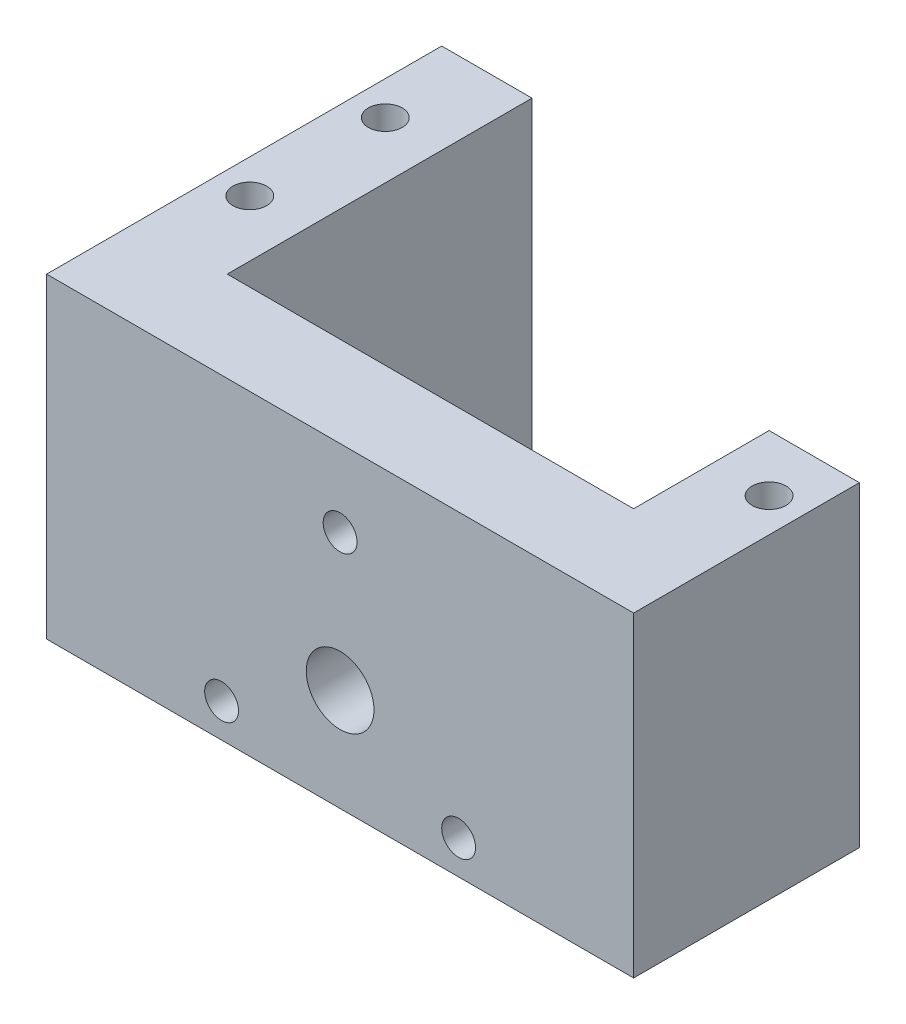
ISO-10303-21;
HEADER;
FILE_DESCRIPTION(('STEP AP214'),'2;1');
FILE_NAME('part.step','',(''),(''),'','','');
FILE_SCHEMA(('AUTOMOTIVE_DESIGN { 1 0 10303 214 1 1 1 1 }'));
ENDSEC;
DATA;
#1=APPLICATION_CONTEXT('core data for automotive mechanical design processes');
#2=APPLICATION_PROTOCOL_DEFINITION('international standard','automotive_design',2000,#1);
#3=PRODUCT_CONTEXT('',#1,'mechanical');
#4=PRODUCT('Part','Part','',(#3));
#5=PRODUCT_RELATED_PRODUCT_CATEGORY('part','',(#4));
#6=PRODUCT_DEFINITION_FORMATION('','',#4);
#7=PRODUCT_DEFINITION_CONTEXT('part definition',#1,'design');
#8=PRODUCT_DEFINITION('design','',#6,#7);
#9=PRODUCT_DEFINITION_SHAPE('','',#8);
#10=(LENGTH_UNIT() NAMED_UNIT(*) SI_UNIT(.MILLI.,.METRE.));
#11=(NAMED_UNIT(*) PLANE_ANGLE_UNIT() SI_UNIT($,.RADIAN.));
#12=(NAMED_UNIT(*) SI_UNIT($,.STERADIAN.) SOLID_ANGLE_UNIT());
#13=UNCERTAINTY_MEASURE_WITH_UNIT(LENGTH_MEASURE(1.E-05),#10,'distance_accuracy_value','');
#14=(GEOMETRIC_REPRESENTATION_CONTEXT(3) GLOBAL_UNCERTAINTY_ASSIGNED_CONTEXT((#13)) GLOBAL_UNIT_ASSIGNED_CONTEXT((#10,
#11,#12)) REPRESENTATION_CONTEXT('',''));
#15=CARTESIAN_POINT('',(0.,0.,0.));
#16=DIRECTION('',(0.,0.,1.));
#17=DIRECTION('',(1.,0.,0.));
#18=AXIS2_PLACEMENT_3D('',#15,#16,#17);
#19=CARTESIAN_POINT('',(-18.,14.,8.));
#20=DIRECTION('',(0.,-1.,0.));
#21=DIRECTION('',(1.,0.,0.));
#22=AXIS2_PLACEMENT_3D('',#19,#20,#21);
#23=PLANE('',#22);
#24=CARTESIAN_POINT('',(-23.,14.,-15.));
#25=DIRECTION('',(0.,-1.,0.));
#26=DIRECTION('',(-1.,0.,0.));
#27=AXIS2_PLACEMENT_3D('',#24,#25,#26);
#28=CIRCLE('',#27,1.5);
#29=CARTESIAN_POINT('',(-24.5,14.,-15.));
#30=VERTEX_POINT('',#29);
#31=EDGE_CURVE('E158',#30,#30,#28,.T.);
#32=ORIENTED_EDGE('',*,*,#31,.T.);
#33=EDGE_LOOP('',(#32));
#34=FACE_BOUND('',#33,.T.);
#35=CARTESIAN_POINT('',(23.,14.,-15.));
#36=DIRECTION('',(0.,-1.,0.));
#37=DIRECTION('',(-1.,0.,0.));
#38=AXIS2_PLACEMENT_3D('',#35,#36,#37);
#39=CIRCLE('',#38,1.5);
#40=CARTESIAN_POINT('',(21.5,14.,-15.));
#41=VERTEX_POINT('',#40);
#42=EDGE_CURVE('E224',#41,#41,#39,.T.);
#43=ORIENTED_EDGE('',*,*,#42,.T.);
#44=EDGE_LOOP('',(#43));
#45=FACE_BOUND('',#44,.T.);
#46=CARTESIAN_POINT('',(-23.,14.,-27.));
#47=DIRECTION('',(0.,-1.,0.));
#48=DIRECTION('',(-1.,0.,0.));
#49=AXIS2_PLACEMENT_3D('',#46,#47,#48);
#50=CIRCLE('',#49,1.5);
#51=CARTESIAN_POINT('',(-24.5,14.,-27.));
#52=VERTEX_POINT('',#51);
#53=EDGE_CURVE('E163',#52,#52,#50,.T.);
#54=ORIENTED_EDGE('',*,*,#53,.T.);
#55=EDGE_LOOP('',(#54));
#56=FACE_BOUND('',#55,.T.);
#57=DIRECTION('',(0.,0.,-1.));
#58=VECTOR('',#57,1.);
#59=CARTESIAN_POINT('',(26.,14.,35.));
#60=LINE('',#59,#58);
#61=CARTESIAN_POINT('',(26.,14.,0.));
#62=VERTEX_POINT('',#61);
#63=CARTESIAN_POINT('',(26.,14.,-20.));
#64=VERTEX_POINT('',#63);
#65=EDGE_CURVE('E39',#62,#64,#60,.T.);
#66=ORIENTED_EDGE('',*,*,#65,.T.);
#67=DIRECTION('',(1.,0.,0.));
#68=VECTOR('',#67,1.);
#69=CARTESIAN_POINT('',(18.,14.,-20.));
#70=LINE('',#69,#68);
#71=CARTESIAN_POINT('',(18.,14.,-20.));
#72=VERTEX_POINT('',#71);
#73=EDGE_CURVE('E100',#72,#64,#70,.T.);
#74=ORIENTED_EDGE('',*,*,#73,.F.);
#75=DIRECTION('',(0.,0.,1.));
#76=VECTOR('',#75,1.);
#77=CARTESIAN_POINT('',(18.,14.,-35.));
#78=LINE('',#77,#76);
#79=CARTESIAN_POINT('',(18.,14.,-8.));
#80=VERTEX_POINT('',#79);
#81=EDGE_CURVE('E110',#72,#80,#78,.T.);
#82=ORIENTED_EDGE('',*,*,#81,.T.);
#83=DIRECTION('',(-1.,0.,0.));
#84=VECTOR('',#83,1.);
#85=CARTESIAN_POINT('',(-18.,14.,-8.));
#86=LINE('',#85,#84);
#87=CARTESIAN_POINT('',(-18.,14.,-8.));
#88=VERTEX_POINT('',#87);
#89=EDGE_CURVE('E145',#80,#88,#86,.T.);
#90=ORIENTED_EDGE('',*,*,#89,.T.);
#91=DIRECTION('',(0.,0.,1.));
#92=VECTOR('',#91,1.);
#93=CARTESIAN_POINT('',(-18.,14.,-35.));
#94=LINE('',#93,#92);
#95=CARTESIAN_POINT('',(-18.,14.,-35.));
#96=VERTEX_POINT('',#95);
#97=EDGE_CURVE('E123',#96,#88,#94,.T.);
#98=ORIENTED_EDGE('',*,*,#97,.F.);
#99=DIRECTION('',(1.,0.,0.));
#100=VECTOR('',#99,1.);
#101=CARTESIAN_POINT('',(-18.,14.,-35.));
#102=LINE('',#101,#100);
#103=CARTESIAN_POINT('',(-26.,14.,-35.));
#104=VERTEX_POINT('',#103);
#105=EDGE_CURVE('E157',#104,#96,#102,.T.);
#106=ORIENTED_EDGE('',*,*,#105,.F.);
#107=DIRECTION('',(0.,0.,-1.));
#108=VECTOR('',#107,1.);
#109=CARTESIAN_POINT('',(-26.,14.,35.));
#110=LINE('',#109,#108);
#111=CARTESIAN_POINT('',(-26.,14.,0.));
#112=VERTEX_POINT('',#111);
#113=EDGE_CURVE('E166',#112,#104,#110,.T.);
#114=ORIENTED_EDGE('',*,*,#113,.F.);
#115=DIRECTION('',(1.,0.,0.));
#116=VECTOR('',#115,1.);
#117=CARTESIAN_POINT('',(0.,14.,0.));
#118=LINE('',#117,#116);
#119=EDGE_CURVE('E58',#112,#62,#118,.T.);
#120=ORIENTED_EDGE('',*,*,#119,.T.);
#121=EDGE_LOOP('',(#66,#74,#82,#90,#98,#106,#114,#120));
#122=FACE_BOUND('',#121,.T.);
#123=ADVANCED_FACE('F36',(#34,#45,#56,#122),#23,.F.);
#124=CARTESIAN_POINT('',(-18.,-14.,8.));
#125=DIRECTION('',(0.,1.,0.));
#126=DIRECTION('',(-1.,0.,0.));
#127=AXIS2_PLACEMENT_3D('',#124,#125,#126);
#128=PLANE('',#127);
#129=CARTESIAN_POINT('',(-23.,-14.,-15.));
#130=DIRECTION('',(0.,-1.,0.));
#131=DIRECTION('',(-1.,0.,0.));
#132=AXIS2_PLACEMENT_3D('',#129,#130,#131);
#133=CIRCLE('',#132,1.5);
#134=CARTESIAN_POINT('',(-24.5,-14.,-15.));
#135=VERTEX_POINT('',#134);
#136=EDGE_CURVE('E154',#135,#135,#133,.T.);
#137=ORIENTED_EDGE('',*,*,#136,.F.);
#138=EDGE_LOOP('',(#137));
#139=FACE_BOUND('',#138,.T.);
#140=CARTESIAN_POINT('',(23.,-14.,-15.));
#141=DIRECTION('',(0.,-1.,0.));
#142=DIRECTION('',(-1.,0.,0.));
#143=AXIS2_PLACEMENT_3D('',#140,#141,#142);
#144=CIRCLE('',#143,1.5);
#145=CARTESIAN_POINT('',(21.5,-14.,-15.));
#146=VERTEX_POINT('',#145);
#147=EDGE_CURVE('E159',#146,#146,#144,.T.);
#148=ORIENTED_EDGE('',*,*,#147,.F.);
#149=EDGE_LOOP('',(#148));
#150=FACE_BOUND('',#149,.T.);
#151=CARTESIAN_POINT('',(-23.,-14.,-27.));
#152=DIRECTION('',(0.,-1.,0.));
#153=DIRECTION('',(-1.,0.,0.));
#154=AXIS2_PLACEMENT_3D('',#151,#152,#153);
#155=CIRCLE('',#154,1.5);
#156=CARTESIAN_POINT('',(-24.5,-14.,-27.));
#157=VERTEX_POINT('',#156);
#158=EDGE_CURVE('E162',#157,#157,#155,.T.);
#159=ORIENTED_EDGE('',*,*,#158,.F.);
#160=EDGE_LOOP('',(#159));
#161=FACE_BOUND('',#160,.T.);
#162=DIRECTION('',(0.,0.,1.));
#163=VECTOR('',#162,1.);
#164=CARTESIAN_POINT('',(18.,-14.,-35.));
#165=LINE('',#164,#163);
#166=CARTESIAN_POINT('',(18.,-14.,-20.));
#167=VERTEX_POINT('',#166);
#168=CARTESIAN_POINT('',(18.,-14.,-8.));
#169=VERTEX_POINT('',#168);
#170=EDGE_CURVE('E118',#167,#169,#165,.T.);
#171=ORIENTED_EDGE('',*,*,#170,.F.);
#172=DIRECTION('',(1.,0.,0.));
#173=VECTOR('',#172,1.);
#174=CARTESIAN_POINT('',(-18.,-14.,-20.));
#175=LINE('',#174,#173);
#176=CARTESIAN_POINT('',(26.,-14.,-20.));
#177=VERTEX_POINT('',#176);
#178=EDGE_CURVE('E50',#167,#177,#175,.T.);
#179=ORIENTED_EDGE('',*,*,#178,.T.);
#180=DIRECTION('',(0.,0.,-1.));
#181=VECTOR('',#180,1.);
#182=CARTESIAN_POINT('',(26.,-14.,35.));
#183=LINE('',#182,#181);
#184=CARTESIAN_POINT('',(26.,-14.,0.));
#185=VERTEX_POINT('',#184);
#186=EDGE_CURVE('E11',#185,#177,#183,.T.);
#187=ORIENTED_EDGE('',*,*,#186,.F.);
#188=DIRECTION('',(1.,0.,0.));
#189=VECTOR('',#188,1.);
#190=CARTESIAN_POINT('',(-18.,-14.,0.));
#191=LINE('',#190,#189);
#192=CARTESIAN_POINT('',(-26.,-14.,0.));
#193=VERTEX_POINT('',#192);
#194=EDGE_CURVE('E177',#193,#185,#191,.T.);
#195=ORIENTED_EDGE('',*,*,#194,.F.);
#196=DIRECTION('',(0.,0.,-1.));
#197=VECTOR('',#196,1.);
#198=CARTESIAN_POINT('',(-26.,-14.,35.));
#199=LINE('',#198,#197);
#200=CARTESIAN_POINT('',(-26.,-14.,-35.));
#201=VERTEX_POINT('',#200);
#202=EDGE_CURVE('E153',#193,#201,#199,.T.);
#203=ORIENTED_EDGE('',*,*,#202,.T.);
#204=DIRECTION('',(-1.,0.,0.));
#205=VECTOR('',#204,1.);
#206=CARTESIAN_POINT('',(-18.,-14.,-35.));
#207=LINE('',#206,#205);
#208=CARTESIAN_POINT('',(-18.,-14.,-35.));
#209=VERTEX_POINT('',#208);
#210=EDGE_CURVE('E175',#209,#201,#207,.T.);
#211=ORIENTED_EDGE('',*,*,#210,.F.);
#212=DIRECTION('',(0.,0.,1.));
#213=VECTOR('',#212,1.);
#214=CARTESIAN_POINT('',(-18.,-14.,-35.));
#215=LINE('',#214,#213);
#216=CARTESIAN_POINT('',(-18.,-14.,-8.));
#217=VERTEX_POINT('',#216);
#218=EDGE_CURVE('E119',#209,#217,#215,.T.);
#219=ORIENTED_EDGE('',*,*,#218,.T.);
#220=DIRECTION('',(1.,0.,0.));
#221=VECTOR('',#220,1.);
#222=CARTESIAN_POINT('',(-18.,-14.,-8.));
#223=LINE('',#222,#221);
#224=EDGE_CURVE('E150',#217,#169,#223,.T.);
#225=ORIENTED_EDGE('',*,*,#224,.T.);
#226=EDGE_LOOP('',(#171,#179,#187,#195,#203,#211,#219,#225));
#227=FACE_BOUND('',#226,.T.);
#228=ADVANCED_FACE('F173',(#139,#150,#161,#227),#128,.F.);
#229=CARTESIAN_POINT('',(-10.5,-11.,8.));
#230=DIRECTION('',(0.,0.,-1.));
#231=DIRECTION('',(-1.,0.,0.));
#232=AXIS2_PLACEMENT_3D('',#229,#230,#231);
#233=CYLINDRICAL_SURFACE('',#232,1.5);
#234=CARTESIAN_POINT('',(-10.5,-11.,-8.));
#235=DIRECTION('',(0.,0.,1.));
#236=DIRECTION('',(1.,0.,0.));
#237=AXIS2_PLACEMENT_3D('',#234,#235,#236);
#238=CIRCLE('',#237,1.5);
#239=CARTESIAN_POINT('',(-9.,-11.,-8.));
#240=VERTEX_POINT('',#239);
#241=EDGE_CURVE('E141',#240,#240,#238,.T.);
#242=ORIENTED_EDGE('',*,*,#241,.F.);
#243=EDGE_LOOP('',(#242));
#244=FACE_BOUND('',#243,.T.);
#245=CARTESIAN_POINT('',(-10.5,-11.,0.));
#246=DIRECTION('',(0.,0.,1.));
#247=DIRECTION('',(1.,0.,0.));
#248=AXIS2_PLACEMENT_3D('',#245,#246,#247);
#249=CIRCLE('',#248,1.5);
#250=CARTESIAN_POINT('',(-9.,-11.,0.));
#251=VERTEX_POINT('',#250);
#252=EDGE_CURVE('E220',#251,#251,#249,.T.);
#253=ORIENTED_EDGE('',*,*,#252,.T.);
#254=EDGE_LOOP('',(#253));
#255=FACE_BOUND('',#254,.T.);
#256=ADVANCED_FACE('F243',(#244,#255),#233,.F.);
#257=CARTESIAN_POINT('',(0.,7.18653347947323,8.));
#258=DIRECTION('',(0.,0.,-1.));
#259=DIRECTION('',(-1.,0.,0.));
#260=AXIS2_PLACEMENT_3D('',#257,#258,#259);
#261=CYLINDRICAL_SURFACE('',#260,1.5);
#262=CARTESIAN_POINT('',(0.,7.18653347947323,-8.));
#263=DIRECTION('',(0.,0.,1.));
#264=DIRECTION('',(1.,0.,0.));
#265=AXIS2_PLACEMENT_3D('',#262,#263,#264);
#266=CIRCLE('',#265,1.5);
#267=CARTESIAN_POINT('',(1.5,7.18653347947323,-8.));
#268=VERTEX_POINT('',#267);
#269=EDGE_CURVE('E138',#268,#268,#266,.T.);
#270=ORIENTED_EDGE('',*,*,#269,.F.);
#271=EDGE_LOOP('',(#270));
#272=FACE_BOUND('',#271,.T.);
#273=CARTESIAN_POINT('',(0.,7.18653347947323,0.));
#274=DIRECTION('',(0.,0.,1.));
#275=DIRECTION('',(1.,0.,0.));
#276=AXIS2_PLACEMENT_3D('',#273,#274,#275);
#277=CIRCLE('',#276,1.5);
#278=CARTESIAN_POINT('',(1.5,7.18653347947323,0.));
#279=VERTEX_POINT('',#278);
#280=EDGE_CURVE('E217',#279,#279,#277,.T.);
#281=ORIENTED_EDGE('',*,*,#280,.T.);
#282=EDGE_LOOP('',(#281));
#283=FACE_BOUND('',#282,.T.);
#284=ADVANCED_FACE('F345',(#272,#283),#261,.F.);
#285=CARTESIAN_POINT('',(10.5,-11.,8.));
#286=DIRECTION('',(0.,0.,-1.));
#287=DIRECTION('',(-1.,0.,0.));
#288=AXIS2_PLACEMENT_3D('',#285,#286,#287);
#289=CYLINDRICAL_SURFACE('',#288,1.5);
#290=CARTESIAN_POINT('',(10.5,-11.,-8.));
#291=DIRECTION('',(0.,0.,1.));
#292=DIRECTION('',(-1.,0.,0.));
#293=AXIS2_PLACEMENT_3D('',#290,#291,#292);
#294=CIRCLE('',#293,1.5);
#295=CARTESIAN_POINT('',(9.00000000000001,-11.,-8.));
#296=VERTEX_POINT('',#295);
#297=EDGE_CURVE('E135',#296,#296,#294,.T.);
#298=ORIENTED_EDGE('',*,*,#297,.F.);
#299=EDGE_LOOP('',(#298));
#300=FACE_BOUND('',#299,.T.);
#301=CARTESIAN_POINT('',(10.5,-11.,0.));
#302=DIRECTION('',(0.,0.,1.));
#303=DIRECTION('',(1.,0.,0.));
#304=AXIS2_PLACEMENT_3D('',#301,#302,#303);
#305=CIRCLE('',#304,1.5);
#306=CARTESIAN_POINT('',(12.,-11.,0.));
#307=VERTEX_POINT('',#306);
#308=EDGE_CURVE('E210',#307,#307,#305,.T.);
#309=ORIENTED_EDGE('',*,*,#308,.T.);
#310=EDGE_LOOP('',(#309));
#311=FACE_BOUND('',#310,.T.);
#312=ADVANCED_FACE('F357',(#300,#311),#289,.F.);
#313=CARTESIAN_POINT('',(0.,-4.93782217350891,5.));
#314=DIRECTION('',(0.,0.,-1.));
#315=DIRECTION('',(-1.,0.,0.));
#316=AXIS2_PLACEMENT_3D('',#313,#314,#315);
#317=CYLINDRICAL_SURFACE('',#316,3.);
#318=CARTESIAN_POINT('',(0.,-4.93782217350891,-5.));
#319=DIRECTION('',(0.,0.,-1.));
#320=DIRECTION('',(-1.,0.,0.));
#321=AXIS2_PLACEMENT_3D('',#318,#319,#320);
#322=CIRCLE('',#321,3.);
#323=CARTESIAN_POINT('',(-3.,-4.93782217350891,-5.));
#324=VERTEX_POINT('',#323);
#325=EDGE_CURVE('E121',#324,#324,#322,.T.);
#326=ORIENTED_EDGE('',*,*,#325,.T.);
#327=EDGE_LOOP('',(#326));
#328=FACE_BOUND('',#327,.T.);
#329=CARTESIAN_POINT('',(0.,-4.93782217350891,0.));
#330=DIRECTION('',(0.,0.,1.));
#331=DIRECTION('',(1.,0.,0.));
#332=AXIS2_PLACEMENT_3D('',#329,#330,#331);
#333=CIRCLE('',#332,3.);
#334=CARTESIAN_POINT('',(3.,-4.93782217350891,0.));
#335=VERTEX_POINT('',#334);
#336=EDGE_CURVE('E206',#335,#335,#333,.F.);
#337=ORIENTED_EDGE('',*,*,#336,.F.);
#338=EDGE_LOOP('',(#337));
#339=FACE_BOUND('',#338,.T.);
#340=ADVANCED_FACE('F281',(#328,#339),#317,.F.);
#341=CARTESIAN_POINT('',(26.,14.,35.));
#342=DIRECTION('',(1.,0.,0.));
#343=DIRECTION('',(0.,0.,-1.));
#344=AXIS2_PLACEMENT_3D('',#341,#342,#343);
#345=PLANE('',#344);
#346=DIRECTION('',(0.,1.,0.));
#347=VECTOR('',#346,1.);
#348=CARTESIAN_POINT('',(26.,-31.,-20.));
#349=LINE('',#348,#347);
#350=EDGE_CURVE('E105',#177,#64,#349,.T.);
#351=ORIENTED_EDGE('',*,*,#350,.T.);
#352=ORIENTED_EDGE('',*,*,#65,.F.);
#353=DIRECTION('',(0.,1.,0.));
#354=VECTOR('',#353,1.);
#355=CARTESIAN_POINT('',(26.,-40.,0.));
#356=LINE('',#355,#354);
#357=EDGE_CURVE('E205',#185,#62,#356,.T.);
#358=ORIENTED_EDGE('',*,*,#357,.F.);
#359=ORIENTED_EDGE('',*,*,#186,.T.);
#360=EDGE_LOOP('',(#351,#352,#358,#359));
#361=FACE_BOUND('',#360,.T.);
#362=ADVANCED_FACE('F204',(#361),#345,.T.);
#363=CARTESIAN_POINT('',(-26.,14.,35.));
#364=DIRECTION('',(-1.,0.,0.));
#365=DIRECTION('',(0.,-1.,0.));
#366=AXIS2_PLACEMENT_3D('',#363,#364,#365);
#367=PLANE('',#366);
#368=ORIENTED_EDGE('',*,*,#202,.F.);
#369=DIRECTION('',(0.,1.,0.));
#370=VECTOR('',#369,1.);
#371=CARTESIAN_POINT('',(-26.,-40.,0.));
#372=LINE('',#371,#370);
#373=EDGE_CURVE('E207',#193,#112,#372,.T.);
#374=ORIENTED_EDGE('',*,*,#373,.T.);
#375=ORIENTED_EDGE('',*,*,#113,.T.);
#376=DIRECTION('',(0.,1.,0.));
#377=VECTOR('',#376,1.);
#378=CARTESIAN_POINT('',(-26.,14.,-35.));
#379=LINE('',#378,#377);
#380=EDGE_CURVE('E180',#201,#104,#379,.T.);
#381=ORIENTED_EDGE('',*,*,#380,.F.);
#382=EDGE_LOOP('',(#368,#374,#375,#381));
#383=FACE_BOUND('',#382,.T.);
#384=ADVANCED_FACE('F181',(#383),#367,.T.);
#385=CARTESIAN_POINT('',(0.,-4.93782217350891,-8.));
#386=DIRECTION('',(0.,0.,1.));
#387=DIRECTION('',(-1.,0.,0.));
#388=AXIS2_PLACEMENT_3D('',#385,#386,#387);
#389=CYLINDRICAL_SURFACE('',#388,8.5);
#390=CARTESIAN_POINT('',(0.,-4.93782217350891,-8.));
#391=DIRECTION('',(0.,0.,1.));
#392=DIRECTION('',(1.,0.,0.));
#393=AXIS2_PLACEMENT_3D('',#390,#391,#392);
#394=CIRCLE('',#393,8.5);
#395=CARTESIAN_POINT('',(8.5,-4.93782217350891,-8.));
#396=VERTEX_POINT('',#395);
#397=EDGE_CURVE('E132',#396,#396,#394,.T.);
#398=ORIENTED_EDGE('',*,*,#397,.F.);
#399=EDGE_LOOP('',(#398));
#400=FACE_BOUND('',#399,.T.);
#401=CARTESIAN_POINT('',(0.,-4.93782217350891,-5.));
#402=DIRECTION('',(0.,0.,-1.));
#403=DIRECTION('',(-1.,0.,0.));
#404=AXIS2_PLACEMENT_3D('',#401,#402,#403);
#405=CIRCLE('',#404,8.5);
#406=CARTESIAN_POINT('',(-8.5,-4.93782217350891,-5.));
#407=VERTEX_POINT('',#406);
#408=EDGE_CURVE('E129',#407,#407,#405,.T.);
#409=ORIENTED_EDGE('',*,*,#408,.F.);
#410=EDGE_LOOP('',(#409));
#411=FACE_BOUND('',#410,.T.);
#412=ADVANCED_FACE('F383',(#400,#411),#389,.F.);
#413=CARTESIAN_POINT('',(0.,0.,-8.));
#414=DIRECTION('',(0.,0.,-1.));
#415=DIRECTION('',(1.,0.,0.));
#416=AXIS2_PLACEMENT_3D('',#413,#414,#415);
#417=PLANE('',#416);
#418=ORIENTED_EDGE('',*,*,#297,.T.);
#419=EDGE_LOOP('',(#418));
#420=FACE_BOUND('',#419,.T.);
#421=ORIENTED_EDGE('',*,*,#241,.T.);
#422=EDGE_LOOP('',(#421));
#423=FACE_BOUND('',#422,.T.);
#424=DIRECTION('',(0.,1.,0.));
#425=VECTOR('',#424,1.);
#426=CARTESIAN_POINT('',(18.,14.,-8.));
#427=LINE('',#426,#425);
#428=EDGE_CURVE('E117',#169,#80,#427,.T.);
#429=ORIENTED_EDGE('',*,*,#428,.F.);
#430=ORIENTED_EDGE('',*,*,#224,.F.);
#431=DIRECTION('',(0.,-1.,0.));
#432=VECTOR('',#431,1.);
#433=CARTESIAN_POINT('',(-18.,14.,-8.));
#434=LINE('',#433,#432);
#435=EDGE_CURVE('E147',#88,#217,#434,.T.);
#436=ORIENTED_EDGE('',*,*,#435,.F.);
#437=ORIENTED_EDGE('',*,*,#89,.F.);
#438=EDGE_LOOP('',(#429,#430,#436,#437));
#439=FACE_BOUND('',#438,.T.);
#440=ORIENTED_EDGE('',*,*,#269,.T.);
#441=EDGE_LOOP('',(#440));
#442=FACE_BOUND('',#441,.T.);
#443=ORIENTED_EDGE('',*,*,#397,.T.);
#444=EDGE_LOOP('',(#443));
#445=FACE_BOUND('',#444,.T.);
#446=ADVANCED_FACE('F199',(#420,#423,#439,#442,#445),#417,.T.);
#447=CARTESIAN_POINT('',(0.,-4.93782217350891,-5.));
#448=DIRECTION('',(0.,0.,1.));
#449=DIRECTION('',(-1.,0.,0.));
#450=AXIS2_PLACEMENT_3D('',#447,#448,#449);
#451=PLANE('',#450);
#452=ORIENTED_EDGE('',*,*,#325,.F.);
#453=EDGE_LOOP('',(#452));
#454=FACE_BOUND('',#453,.T.);
#455=ORIENTED_EDGE('',*,*,#408,.T.);
#456=EDGE_LOOP('',(#455));
#457=FACE_BOUND('',#456,.T.);
#458=ADVANCED_FACE('F290',(#454,#457),#451,.F.);
#459=CARTESIAN_POINT('',(18.,14.,-35.));
#460=DIRECTION('',(-1.,0.,0.));
#461=DIRECTION('',(0.,0.,-1.));
#462=AXIS2_PLACEMENT_3D('',#459,#460,#461);
#463=PLANE('',#462);
#464=DIRECTION('',(0.,1.,0.));
#465=VECTOR('',#464,1.);
#466=CARTESIAN_POINT('',(18.,-31.,-20.));
#467=LINE('',#466,#465);
#468=EDGE_CURVE('E97',#167,#72,#467,.T.);
#469=ORIENTED_EDGE('',*,*,#468,.F.);
#470=ORIENTED_EDGE('',*,*,#170,.T.);
#471=ORIENTED_EDGE('',*,*,#428,.T.);
#472=ORIENTED_EDGE('',*,*,#81,.F.);
#473=EDGE_LOOP('',(#469,#470,#471,#472));
#474=FACE_BOUND('',#473,.T.);
#475=ADVANCED_FACE('F115',(#474),#463,.T.);
#476=CARTESIAN_POINT('',(-18.,14.,-35.));
#477=DIRECTION('',(1.,0.,0.));
#478=DIRECTION('',(0.,1.,0.));
#479=AXIS2_PLACEMENT_3D('',#476,#477,#478);
#480=PLANE('',#479);
#481=ORIENTED_EDGE('',*,*,#435,.T.);
#482=ORIENTED_EDGE('',*,*,#218,.F.);
#483=DIRECTION('',(0.,-1.,0.));
#484=VECTOR('',#483,1.);
#485=CARTESIAN_POINT('',(-18.,14.,-35.));
#486=LINE('',#485,#484);
#487=EDGE_CURVE('E188',#96,#209,#486,.T.);
#488=ORIENTED_EDGE('',*,*,#487,.F.);
#489=ORIENTED_EDGE('',*,*,#97,.T.);
#490=EDGE_LOOP('',(#481,#482,#488,#489));
#491=FACE_BOUND('',#490,.T.);
#492=ADVANCED_FACE('F195',(#491),#480,.T.);
#493=CARTESIAN_POINT('',(0.,0.,-35.));
#494=DIRECTION('',(0.,0.,-1.));
#495=DIRECTION('',(1.,0.,0.));
#496=AXIS2_PLACEMENT_3D('',#493,#494,#495);
#497=PLANE('',#496);
#498=ORIENTED_EDGE('',*,*,#105,.T.);
#499=ORIENTED_EDGE('',*,*,#487,.T.);
#500=ORIENTED_EDGE('',*,*,#210,.T.);
#501=ORIENTED_EDGE('',*,*,#380,.T.);
#502=EDGE_LOOP('',(#498,#499,#500,#501));
#503=FACE_BOUND('',#502,.T.);
#504=ADVANCED_FACE('F187',(#503),#497,.T.);
#505=CARTESIAN_POINT('',(-23.,-16.,-15.));
#506=DIRECTION('',(0.,1.,0.));
#507=DIRECTION('',(-1.,0.,0.));
#508=AXIS2_PLACEMENT_3D('',#505,#506,#507);
#509=CYLINDRICAL_SURFACE('',#508,1.5);
#510=ORIENTED_EDGE('',*,*,#31,.F.);
#511=EDGE_LOOP('',(#510));
#512=FACE_BOUND('',#511,.T.);
#513=ORIENTED_EDGE('',*,*,#136,.T.);
#514=EDGE_LOOP('',(#513));
#515=FACE_BOUND('',#514,.T.);
#516=ADVANCED_FACE('F234',(#512,#515),#509,.F.);
#517=CARTESIAN_POINT('',(23.,-16.,-15.));
#518=DIRECTION('',(0.,1.,0.));
#519=DIRECTION('',(-1.,0.,0.));
#520=AXIS2_PLACEMENT_3D('',#517,#518,#519);
#521=CYLINDRICAL_SURFACE('',#520,1.5);
#522=ORIENTED_EDGE('',*,*,#42,.F.);
#523=EDGE_LOOP('',(#522));
#524=FACE_BOUND('',#523,.T.);
#525=ORIENTED_EDGE('',*,*,#147,.T.);
#526=EDGE_LOOP('',(#525));
#527=FACE_BOUND('',#526,.T.);
#528=ADVANCED_FACE('F237',(#524,#527),#521,.F.);
#529=CARTESIAN_POINT('',(-23.,-16.,-27.));
#530=DIRECTION('',(0.,1.,0.));
#531=DIRECTION('',(-1.,0.,0.));
#532=AXIS2_PLACEMENT_3D('',#529,#530,#531);
#533=CYLINDRICAL_SURFACE('',#532,1.5);
#534=ORIENTED_EDGE('',*,*,#53,.F.);
#535=EDGE_LOOP('',(#534));
#536=FACE_BOUND('',#535,.T.);
#537=ORIENTED_EDGE('',*,*,#158,.T.);
#538=EDGE_LOOP('',(#537));
#539=FACE_BOUND('',#538,.T.);
#540=ADVANCED_FACE('F248',(#536,#539),#533,.F.);
#541=CARTESIAN_POINT('',(0.,-40.,0.));
#542=DIRECTION('',(0.,0.,1.));
#543=DIRECTION('',(1.,0.,0.));
#544=AXIS2_PLACEMENT_3D('',#541,#542,#543);
#545=PLANE('',#544);
#546=ORIENTED_EDGE('',*,*,#336,.T.);
#547=EDGE_LOOP('',(#546));
#548=FACE_BOUND('',#547,.T.);
#549=ORIENTED_EDGE('',*,*,#308,.F.);
#550=EDGE_LOOP('',(#549));
#551=FACE_BOUND('',#550,.T.);
#552=ORIENTED_EDGE('',*,*,#280,.F.);
#553=EDGE_LOOP('',(#552));
#554=FACE_BOUND('',#553,.T.);
#555=ORIENTED_EDGE('',*,*,#252,.F.);
#556=EDGE_LOOP('',(#555));
#557=FACE_BOUND('',#556,.T.);
#558=ORIENTED_EDGE('',*,*,#194,.T.);
#559=ORIENTED_EDGE('',*,*,#357,.T.);
#560=ORIENTED_EDGE('',*,*,#119,.F.);
#561=ORIENTED_EDGE('',*,*,#373,.F.);
#562=EDGE_LOOP('',(#558,#559,#560,#561));
#563=FACE_BOUND('',#562,.T.);
#564=ADVANCED_FACE('F250',(#548,#551,#554,#557,#563),#545,.T.);
#565=CARTESIAN_POINT('',(18.,-31.,-20.));
#566=DIRECTION('',(0.,0.,1.));
#567=DIRECTION('',(1.,0.,0.));
#568=AXIS2_PLACEMENT_3D('',#565,#566,#567);
#569=PLANE('',#568);
#570=ORIENTED_EDGE('',*,*,#468,.T.);
#571=ORIENTED_EDGE('',*,*,#73,.T.);
#572=ORIENTED_EDGE('',*,*,#350,.F.);
#573=ORIENTED_EDGE('',*,*,#178,.F.);
#574=EDGE_LOOP('',(#570,#571,#572,#573));
#575=FACE_BOUND('',#574,.T.);
#576=ADVANCED_FACE('F99',(#575),#569,.F.);
#577=CLOSED_SHELL('',(#123,#228,#256,#284,#312,#340,#362,#384,#412,#446,#458,#475,#492,#504,
#516,#528,#540,#564,#576));
#578=MANIFOLD_SOLID_BREP('B2',#577);
#579=ADVANCED_BREP_SHAPE_REPRESENTATION('',(#18,#578),#14);
#580=SHAPE_DEFINITION_REPRESENTATION(#9,#579);
ENDSEC;
END-ISO-10303-21;
